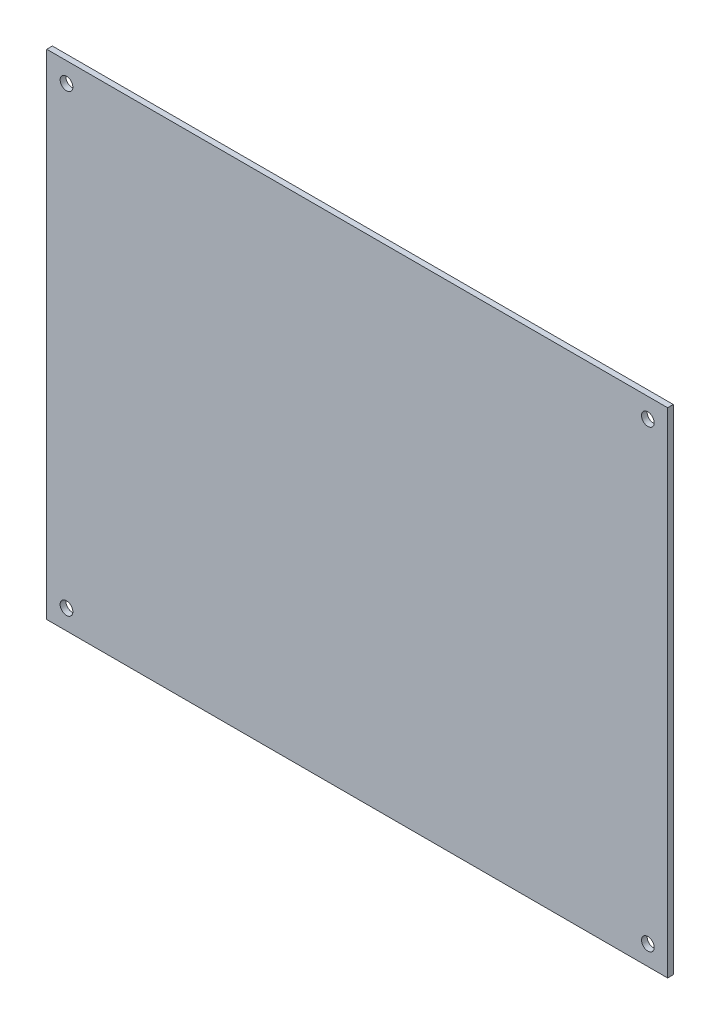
ISO-10303-21;
HEADER;
FILE_DESCRIPTION(('STEP AP214'),'2;1');
FILE_NAME('part.step','',(''),(''),'','','');
FILE_SCHEMA(('AUTOMOTIVE_DESIGN { 1 0 10303 214 1 1 1 1 }'));
ENDSEC;
DATA;
#1=APPLICATION_CONTEXT('core data for automotive mechanical design processes');
#2=APPLICATION_PROTOCOL_DEFINITION('international standard','automotive_design',2000,#1);
#3=PRODUCT_CONTEXT('',#1,'mechanical');
#4=PRODUCT('Part','Part','',(#3));
#5=PRODUCT_RELATED_PRODUCT_CATEGORY('part','',(#4));
#6=PRODUCT_DEFINITION_FORMATION('','',#4);
#7=PRODUCT_DEFINITION_CONTEXT('part definition',#1,'design');
#8=PRODUCT_DEFINITION('design','',#6,#7);
#9=PRODUCT_DEFINITION_SHAPE('','',#8);
#10=(LENGTH_UNIT() NAMED_UNIT(*) SI_UNIT(.MILLI.,.METRE.));
#11=(NAMED_UNIT(*) PLANE_ANGLE_UNIT() SI_UNIT($,.RADIAN.));
#12=(NAMED_UNIT(*) SI_UNIT($,.STERADIAN.) SOLID_ANGLE_UNIT());
#13=UNCERTAINTY_MEASURE_WITH_UNIT(LENGTH_MEASURE(1.E-05),#10,'distance_accuracy_value','');
#14=(GEOMETRIC_REPRESENTATION_CONTEXT(3) GLOBAL_UNCERTAINTY_ASSIGNED_CONTEXT((#13)) GLOBAL_UNIT_ASSIGNED_CONTEXT((#10,
#11,#12)) REPRESENTATION_CONTEXT('',''));
#15=CARTESIAN_POINT('',(0.,0.,0.));
#16=DIRECTION('',(0.,0.,1.));
#17=DIRECTION('',(1.,0.,0.));
#18=AXIS2_PLACEMENT_3D('',#15,#16,#17);
#19=CARTESIAN_POINT('',(0.,0.,2.));
#20=DIRECTION('',(1.,0.,0.));
#21=DIRECTION('',(0.,0.,-1.));
#22=AXIS2_PLACEMENT_3D('',#19,#20,#21);
#23=PLANE('',#22);
#24=DIRECTION('',(0.,-1.,0.));
#25=VECTOR('',#24,1.);
#26=CARTESIAN_POINT('',(0.,0.,0.));
#27=LINE('',#26,#25);
#28=CARTESIAN_POINT('',(0.,175.,0.));
#29=VERTEX_POINT('',#28);
#30=CARTESIAN_POINT('',(0.,0.,0.));
#31=VERTEX_POINT('',#30);
#32=EDGE_CURVE('E103',#29,#31,#27,.T.);
#33=ORIENTED_EDGE('',*,*,#32,.T.);
#34=DIRECTION('',(0.,0.,-1.));
#35=VECTOR('',#34,1.);
#36=CARTESIAN_POINT('',(0.,0.,2.));
#37=LINE('',#36,#35);
#38=CARTESIAN_POINT('',(0.,0.,2.));
#39=VERTEX_POINT('',#38);
#40=EDGE_CURVE('E11',#39,#31,#37,.T.);
#41=ORIENTED_EDGE('',*,*,#40,.F.);
#42=DIRECTION('',(0.,-1.,0.));
#43=VECTOR('',#42,1.);
#44=CARTESIAN_POINT('',(0.,0.,2.));
#45=LINE('',#44,#43);
#46=CARTESIAN_POINT('',(0.,175.,2.));
#47=VERTEX_POINT('',#46);
#48=EDGE_CURVE('E93',#47,#39,#45,.T.);
#49=ORIENTED_EDGE('',*,*,#48,.F.);
#50=DIRECTION('',(0.,0.,-1.));
#51=VECTOR('',#50,1.);
#52=CARTESIAN_POINT('',(0.,175.,2.));
#53=LINE('',#52,#51);
#54=EDGE_CURVE('E97',#47,#29,#53,.T.);
#55=ORIENTED_EDGE('',*,*,#54,.T.);
#56=EDGE_LOOP('',(#33,#41,#49,#55));
#57=FACE_BOUND('',#56,.T.);
#58=ADVANCED_FACE('F37',(#57),#23,.F.);
#59=CARTESIAN_POINT('',(0.,0.,2.));
#60=DIRECTION('',(0.,1.,0.));
#61=DIRECTION('',(0.,0.,1.));
#62=AXIS2_PLACEMENT_3D('',#59,#60,#61);
#63=PLANE('',#62);
#64=DIRECTION('',(1.,0.,0.));
#65=VECTOR('',#64,1.);
#66=CARTESIAN_POINT('',(0.,0.,0.));
#67=LINE('',#66,#65);
#68=CARTESIAN_POINT('',(220.,0.,0.));
#69=VERTEX_POINT('',#68);
#70=EDGE_CURVE('E92',#31,#69,#67,.T.);
#71=ORIENTED_EDGE('',*,*,#70,.T.);
#72=DIRECTION('',(0.,0.,-1.));
#73=VECTOR('',#72,1.);
#74=CARTESIAN_POINT('',(220.,0.,2.));
#75=LINE('',#74,#73);
#76=CARTESIAN_POINT('',(220.,0.,2.));
#77=VERTEX_POINT('',#76);
#78=EDGE_CURVE('E48',#77,#69,#75,.T.);
#79=ORIENTED_EDGE('',*,*,#78,.F.);
#80=DIRECTION('',(1.,0.,0.));
#81=VECTOR('',#80,1.);
#82=CARTESIAN_POINT('',(0.,0.,2.));
#83=LINE('',#82,#81);
#84=EDGE_CURVE('E88',#39,#77,#83,.T.);
#85=ORIENTED_EDGE('',*,*,#84,.F.);
#86=ORIENTED_EDGE('',*,*,#40,.T.);
#87=EDGE_LOOP('',(#71,#79,#85,#86));
#88=FACE_BOUND('',#87,.T.);
#89=ADVANCED_FACE('F94',(#88),#63,.F.);
#90=CARTESIAN_POINT('',(220.,0.,2.));
#91=DIRECTION('',(-1.,0.,0.));
#92=DIRECTION('',(0.,0.,1.));
#93=AXIS2_PLACEMENT_3D('',#90,#91,#92);
#94=PLANE('',#93);
#95=DIRECTION('',(0.,1.,0.));
#96=VECTOR('',#95,1.);
#97=CARTESIAN_POINT('',(220.,0.,0.));
#98=LINE('',#97,#96);
#99=CARTESIAN_POINT('',(220.,175.,0.));
#100=VERTEX_POINT('',#99);
#101=EDGE_CURVE('E71',#69,#100,#98,.T.);
#102=ORIENTED_EDGE('',*,*,#101,.T.);
#103=DIRECTION('',(0.,0.,-1.));
#104=VECTOR('',#103,1.);
#105=CARTESIAN_POINT('',(220.,175.,2.));
#106=LINE('',#105,#104);
#107=CARTESIAN_POINT('',(220.,175.,2.));
#108=VERTEX_POINT('',#107);
#109=EDGE_CURVE('E96',#108,#100,#106,.T.);
#110=ORIENTED_EDGE('',*,*,#109,.F.);
#111=DIRECTION('',(0.,1.,0.));
#112=VECTOR('',#111,1.);
#113=CARTESIAN_POINT('',(220.,0.,2.));
#114=LINE('',#113,#112);
#115=EDGE_CURVE('E90',#77,#108,#114,.T.);
#116=ORIENTED_EDGE('',*,*,#115,.F.);
#117=ORIENTED_EDGE('',*,*,#78,.T.);
#118=EDGE_LOOP('',(#102,#110,#116,#117));
#119=FACE_BOUND('',#118,.T.);
#120=ADVANCED_FACE('F100',(#119),#94,.F.);
#121=CARTESIAN_POINT('',(0.,175.,2.));
#122=DIRECTION('',(0.,-1.,0.));
#123=DIRECTION('',(0.,0.,-1.));
#124=AXIS2_PLACEMENT_3D('',#121,#122,#123);
#125=PLANE('',#124);
#126=DIRECTION('',(-1.,0.,0.));
#127=VECTOR('',#126,1.);
#128=CARTESIAN_POINT('',(0.,175.,0.));
#129=LINE('',#128,#127);
#130=EDGE_CURVE('E76',#100,#29,#129,.T.);
#131=ORIENTED_EDGE('',*,*,#130,.T.);
#132=ORIENTED_EDGE('',*,*,#54,.F.);
#133=DIRECTION('',(-1.,0.,0.));
#134=VECTOR('',#133,1.);
#135=CARTESIAN_POINT('',(0.,175.,2.));
#136=LINE('',#135,#134);
#137=EDGE_CURVE('E57',#108,#47,#136,.T.);
#138=ORIENTED_EDGE('',*,*,#137,.F.);
#139=ORIENTED_EDGE('',*,*,#109,.T.);
#140=EDGE_LOOP('',(#131,#132,#138,#139));
#141=FACE_BOUND('',#140,.T.);
#142=ADVANCED_FACE('F112',(#141),#125,.F.);
#143=CARTESIAN_POINT('',(0.,0.,2.));
#144=DIRECTION('',(0.,0.,-1.));
#145=DIRECTION('',(-1.,0.,0.));
#146=AXIS2_PLACEMENT_3D('',#143,#144,#145);
#147=PLANE('',#146);
#148=CARTESIAN_POINT('',(213.,7.,2.));
#149=DIRECTION('',(0.,0.,1.));
#150=DIRECTION('',(1.,0.,0.));
#151=AXIS2_PLACEMENT_3D('',#148,#149,#150);
#152=CIRCLE('',#151,2.25000000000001);
#153=CARTESIAN_POINT('',(215.25,7.,2.));
#154=VERTEX_POINT('',#153);
#155=EDGE_CURVE('E118',#154,#154,#152,.T.);
#156=ORIENTED_EDGE('',*,*,#155,.F.);
#157=EDGE_LOOP('',(#156));
#158=FACE_BOUND('',#157,.T.);
#159=CARTESIAN_POINT('',(7.,168.,2.));
#160=DIRECTION('',(0.,0.,1.));
#161=DIRECTION('',(1.,0.,0.));
#162=AXIS2_PLACEMENT_3D('',#159,#160,#161);
#163=CIRCLE('',#162,2.25);
#164=CARTESIAN_POINT('',(9.25,168.,2.));
#165=VERTEX_POINT('',#164);
#166=EDGE_CURVE('E127',#165,#165,#163,.T.);
#167=ORIENTED_EDGE('',*,*,#166,.F.);
#168=EDGE_LOOP('',(#167));
#169=FACE_BOUND('',#168,.T.);
#170=CARTESIAN_POINT('',(7.,7.,2.));
#171=DIRECTION('',(0.,0.,1.));
#172=DIRECTION('',(1.,0.,0.));
#173=AXIS2_PLACEMENT_3D('',#170,#171,#172);
#174=CIRCLE('',#173,2.25);
#175=CARTESIAN_POINT('',(9.25,7.,2.));
#176=VERTEX_POINT('',#175);
#177=EDGE_CURVE('E130',#176,#176,#174,.T.);
#178=ORIENTED_EDGE('',*,*,#177,.F.);
#179=EDGE_LOOP('',(#178));
#180=FACE_BOUND('',#179,.T.);
#181=CARTESIAN_POINT('',(213.,168.,2.));
#182=DIRECTION('',(0.,0.,1.));
#183=DIRECTION('',(1.,0.,0.));
#184=AXIS2_PLACEMENT_3D('',#181,#182,#183);
#185=CIRCLE('',#184,2.25000000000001);
#186=CARTESIAN_POINT('',(215.25,168.,2.));
#187=VERTEX_POINT('',#186);
#188=EDGE_CURVE('E120',#187,#187,#185,.T.);
#189=ORIENTED_EDGE('',*,*,#188,.F.);
#190=EDGE_LOOP('',(#189));
#191=FACE_BOUND('',#190,.T.);
#192=ORIENTED_EDGE('',*,*,#48,.T.);
#193=ORIENTED_EDGE('',*,*,#84,.T.);
#194=ORIENTED_EDGE('',*,*,#115,.T.);
#195=ORIENTED_EDGE('',*,*,#137,.T.);
#196=EDGE_LOOP('',(#192,#193,#194,#195));
#197=FACE_BOUND('',#196,.T.);
#198=ADVANCED_FACE('F87',(#158,#169,#180,#191,#197),#147,.F.);
#199=CARTESIAN_POINT('',(0.,0.,0.));
#200=DIRECTION('',(0.,0.,-1.));
#201=DIRECTION('',(-1.,0.,0.));
#202=AXIS2_PLACEMENT_3D('',#199,#200,#201);
#203=PLANE('',#202);
#204=CARTESIAN_POINT('',(213.,7.,0.));
#205=DIRECTION('',(0.,0.,1.));
#206=DIRECTION('',(1.,0.,0.));
#207=AXIS2_PLACEMENT_3D('',#204,#205,#206);
#208=CIRCLE('',#207,2.25000000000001);
#209=CARTESIAN_POINT('',(215.25,7.,0.));
#210=VERTEX_POINT('',#209);
#211=EDGE_CURVE('E128',#210,#210,#208,.T.);
#212=ORIENTED_EDGE('',*,*,#211,.T.);
#213=EDGE_LOOP('',(#212));
#214=FACE_BOUND('',#213,.T.);
#215=CARTESIAN_POINT('',(7.,168.,0.));
#216=DIRECTION('',(0.,0.,1.));
#217=DIRECTION('',(1.,0.,0.));
#218=AXIS2_PLACEMENT_3D('',#215,#216,#217);
#219=CIRCLE('',#218,2.25);
#220=CARTESIAN_POINT('',(9.25,168.,0.));
#221=VERTEX_POINT('',#220);
#222=EDGE_CURVE('E121',#221,#221,#219,.T.);
#223=ORIENTED_EDGE('',*,*,#222,.T.);
#224=EDGE_LOOP('',(#223));
#225=FACE_BOUND('',#224,.T.);
#226=CARTESIAN_POINT('',(7.,7.,0.));
#227=DIRECTION('',(0.,0.,1.));
#228=DIRECTION('',(1.,0.,0.));
#229=AXIS2_PLACEMENT_3D('',#226,#227,#228);
#230=CIRCLE('',#229,2.25);
#231=CARTESIAN_POINT('',(9.25,7.,0.));
#232=VERTEX_POINT('',#231);
#233=EDGE_CURVE('E133',#232,#232,#230,.T.);
#234=ORIENTED_EDGE('',*,*,#233,.T.);
#235=EDGE_LOOP('',(#234));
#236=FACE_BOUND('',#235,.T.);
#237=CARTESIAN_POINT('',(213.,168.,0.));
#238=DIRECTION('',(0.,0.,1.));
#239=DIRECTION('',(1.,0.,0.));
#240=AXIS2_PLACEMENT_3D('',#237,#238,#239);
#241=CIRCLE('',#240,2.25000000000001);
#242=CARTESIAN_POINT('',(215.25,168.,0.));
#243=VERTEX_POINT('',#242);
#244=EDGE_CURVE('E106',#243,#243,#241,.T.);
#245=ORIENTED_EDGE('',*,*,#244,.T.);
#246=EDGE_LOOP('',(#245));
#247=FACE_BOUND('',#246,.T.);
#248=ORIENTED_EDGE('',*,*,#32,.F.);
#249=ORIENTED_EDGE('',*,*,#130,.F.);
#250=ORIENTED_EDGE('',*,*,#101,.F.);
#251=ORIENTED_EDGE('',*,*,#70,.F.);
#252=EDGE_LOOP('',(#248,#249,#250,#251));
#253=FACE_BOUND('',#252,.T.);
#254=ADVANCED_FACE('F111',(#214,#225,#236,#247,#253),#203,.T.);
#255=CARTESIAN_POINT('',(213.,168.,0.));
#256=DIRECTION('',(0.,0.,1.));
#257=DIRECTION('',(1.,0.,0.));
#258=AXIS2_PLACEMENT_3D('',#255,#256,#257);
#259=CYLINDRICAL_SURFACE('',#258,2.25000000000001);
#260=ORIENTED_EDGE('',*,*,#244,.F.);
#261=EDGE_LOOP('',(#260));
#262=FACE_BOUND('',#261,.T.);
#263=ORIENTED_EDGE('',*,*,#188,.T.);
#264=EDGE_LOOP('',(#263));
#265=FACE_BOUND('',#264,.T.);
#266=ADVANCED_FACE('F149',(#262,#265),#259,.F.);
#267=CARTESIAN_POINT('',(7.,7.,0.));
#268=DIRECTION('',(0.,0.,1.));
#269=DIRECTION('',(1.,0.,0.));
#270=AXIS2_PLACEMENT_3D('',#267,#268,#269);
#271=CYLINDRICAL_SURFACE('',#270,2.25);
#272=ORIENTED_EDGE('',*,*,#233,.F.);
#273=EDGE_LOOP('',(#272));
#274=FACE_BOUND('',#273,.T.);
#275=ORIENTED_EDGE('',*,*,#177,.T.);
#276=EDGE_LOOP('',(#275));
#277=FACE_BOUND('',#276,.T.);
#278=ADVANCED_FACE('F143',(#274,#277),#271,.F.);
#279=CARTESIAN_POINT('',(7.,168.,0.));
#280=DIRECTION('',(0.,0.,1.));
#281=DIRECTION('',(1.,0.,0.));
#282=AXIS2_PLACEMENT_3D('',#279,#280,#281);
#283=CYLINDRICAL_SURFACE('',#282,2.25);
#284=ORIENTED_EDGE('',*,*,#222,.F.);
#285=EDGE_LOOP('',(#284));
#286=FACE_BOUND('',#285,.T.);
#287=ORIENTED_EDGE('',*,*,#166,.T.);
#288=EDGE_LOOP('',(#287));
#289=FACE_BOUND('',#288,.T.);
#290=ADVANCED_FACE('F160',(#286,#289),#283,.F.);
#291=CARTESIAN_POINT('',(213.,7.,0.));
#292=DIRECTION('',(0.,0.,1.));
#293=DIRECTION('',(1.,0.,0.));
#294=AXIS2_PLACEMENT_3D('',#291,#292,#293);
#295=CYLINDRICAL_SURFACE('',#294,2.25000000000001);
#296=ORIENTED_EDGE('',*,*,#211,.F.);
#297=EDGE_LOOP('',(#296));
#298=FACE_BOUND('',#297,.T.);
#299=ORIENTED_EDGE('',*,*,#155,.T.);
#300=EDGE_LOOP('',(#299));
#301=FACE_BOUND('',#300,.T.);
#302=ADVANCED_FACE('F208',(#298,#301),#295,.F.);
#303=CLOSED_SHELL('',(#58,#89,#120,#142,#198,#254,#266,#278,#290,#302));
#304=MANIFOLD_SOLID_BREP('B2',#303);
#305=ADVANCED_BREP_SHAPE_REPRESENTATION('',(#18,#304),#14);
#306=SHAPE_DEFINITION_REPRESENTATION(#9,#305);
ENDSEC;
END-ISO-10303-21;
